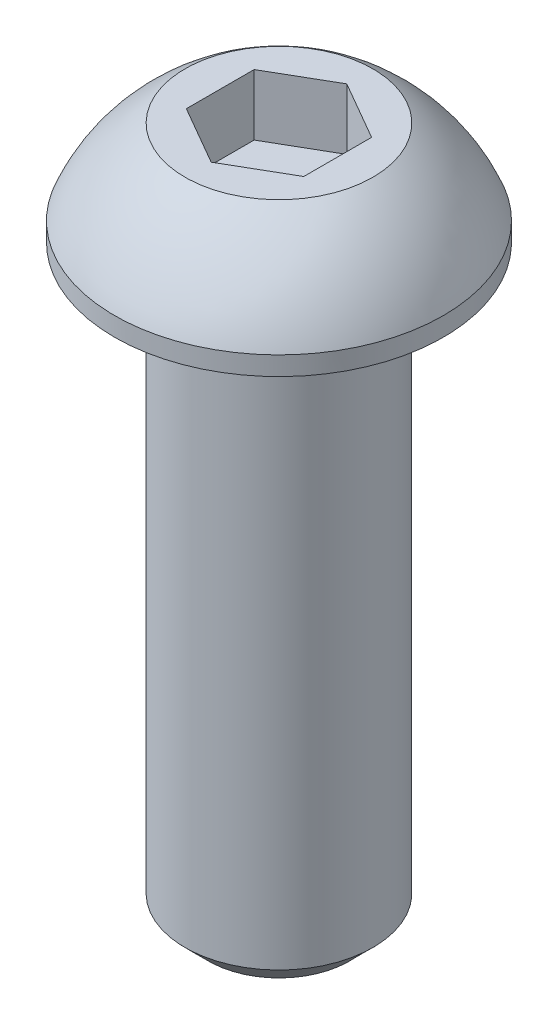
ISO-10303-21;
HEADER;
FILE_DESCRIPTION(('STEP AP214'),'2;1');
FILE_NAME('part.step','',(''),(''),'','','');
FILE_SCHEMA(('AUTOMOTIVE_DESIGN { 1 0 10303 214 1 1 1 1 }'));
ENDSEC;
DATA;
#1=APPLICATION_CONTEXT('core data for automotive mechanical design processes');
#2=APPLICATION_PROTOCOL_DEFINITION('international standard','automotive_design',2000,#1);
#3=PRODUCT_CONTEXT('',#1,'mechanical');
#4=PRODUCT('Part','Part','',(#3));
#5=PRODUCT_RELATED_PRODUCT_CATEGORY('part','',(#4));
#6=PRODUCT_DEFINITION_FORMATION('','',#4);
#7=PRODUCT_DEFINITION_CONTEXT('part definition',#1,'design');
#8=PRODUCT_DEFINITION('design','',#6,#7);
#9=PRODUCT_DEFINITION_SHAPE('','',#8);
#10=(LENGTH_UNIT() NAMED_UNIT(*) SI_UNIT(.MILLI.,.METRE.));
#11=(NAMED_UNIT(*) PLANE_ANGLE_UNIT() SI_UNIT($,.RADIAN.));
#12=(NAMED_UNIT(*) SI_UNIT($,.STERADIAN.) SOLID_ANGLE_UNIT());
#13=UNCERTAINTY_MEASURE_WITH_UNIT(LENGTH_MEASURE(1.E-05),#10,'distance_accuracy_value','');
#14=(GEOMETRIC_REPRESENTATION_CONTEXT(3) GLOBAL_UNCERTAINTY_ASSIGNED_CONTEXT((#13)) GLOBAL_UNIT_ASSIGNED_CONTEXT((#10,
#11,#12)) REPRESENTATION_CONTEXT('',''));
#15=CARTESIAN_POINT('',(0.,0.,0.));
#16=DIRECTION('',(0.,0.,1.));
#17=DIRECTION('',(1.,0.,0.));
#18=AXIS2_PLACEMENT_3D('',#15,#16,#17);
#19=CARTESIAN_POINT('',(0.,0.,0.));
#20=DIRECTION('',(0.,-1.,0.));
#21=DIRECTION('',(0.,0.,-1.));
#22=AXIS2_PLACEMENT_3D('',#19,#20,#21);
#23=PLANE('',#22);
#24=CARTESIAN_POINT('',(0.,0.,0.));
#25=DIRECTION('',(0.,-1.,0.));
#26=DIRECTION('',(0.,0.,-1.));
#27=AXIS2_PLACEMENT_3D('',#24,#25,#26);
#28=CIRCLE('',#27,4.);
#29=CARTESIAN_POINT('',(0.,0.,-4.00000000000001));
#30=VERTEX_POINT('',#29);
#31=EDGE_CURVE('E146',#30,#30,#28,.T.);
#32=ORIENTED_EDGE('',*,*,#31,.F.);
#33=EDGE_LOOP('',(#32));
#34=FACE_BOUND('',#33,.T.);
#35=CARTESIAN_POINT('',(0.,0.,0.));
#36=DIRECTION('',(0.,-1.,0.));
#37=DIRECTION('',(0.,0.,-1.));
#38=AXIS2_PLACEMENT_3D('',#35,#36,#37);
#39=CIRCLE('',#38,7.);
#40=CARTESIAN_POINT('',(0.,0.,-7.00000000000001));
#41=VERTEX_POINT('',#40);
#42=EDGE_CURVE('E143',#41,#41,#39,.T.);
#43=ORIENTED_EDGE('',*,*,#42,.T.);
#44=EDGE_LOOP('',(#43));
#45=FACE_BOUND('',#44,.T.);
#46=ADVANCED_FACE('F29',(#34,#45),#23,.T.);
#47=CARTESIAN_POINT('',(0.,0.,0.));
#48=DIRECTION('',(0.,-1.,0.));
#49=DIRECTION('',(0.,0.,-1.));
#50=AXIS2_PLACEMENT_3D('',#47,#48,#49);
#51=CYLINDRICAL_SURFACE('',#50,7.);
#52=CARTESIAN_POINT('',(0.,0.799999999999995,0.));
#53=DIRECTION('',(0.,-1.,0.));
#54=DIRECTION('',(0.,0.,-1.));
#55=AXIS2_PLACEMENT_3D('',#52,#53,#54);
#56=CIRCLE('',#55,7.);
#57=CARTESIAN_POINT('',(7.00000000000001,0.799999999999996,0.));
#58=VERTEX_POINT('',#57);
#59=EDGE_CURVE('E140',#58,#58,#56,.T.);
#60=ORIENTED_EDGE('',*,*,#59,.T.);
#61=EDGE_LOOP('',(#60));
#62=FACE_BOUND('',#61,.T.);
#63=ORIENTED_EDGE('',*,*,#42,.F.);
#64=EDGE_LOOP('',(#63));
#65=FACE_BOUND('',#64,.T.);
#66=ADVANCED_FACE('F165',(#62,#65),#51,.T.);
#67=CARTESIAN_POINT('',(0.,-1.98333333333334,0.));
#68=DIRECTION('',(0.,-1.,0.));
#69=DIRECTION('',(1.,0.,0.));
#70=AXIS2_PLACEMENT_3D('',#67,#68,#69);
#71=SPHERICAL_SURFACE('',#70,7.53305677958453);
#72=CARTESIAN_POINT('',(0.,4.40000000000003,0.));
#73=DIRECTION('',(0.,-1.,0.));
#74=DIRECTION('',(0.,0.,-1.));
#75=AXIS2_PLACEMENT_3D('',#72,#73,#74);
#76=CIRCLE('',#75,4.);
#77=CARTESIAN_POINT('',(3.99999999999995,4.40000000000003,0.));
#78=VERTEX_POINT('',#77);
#79=EDGE_CURVE('E131',#78,#78,#76,.T.);
#80=CARTESIAN_POINT('',(3.99999999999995,4.40000000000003,0.));
#81=CARTESIAN_POINT('',(4.04206169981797,4.37364288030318,0.));
#82=CARTESIAN_POINT('',(4.08386281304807,4.34686991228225,0.));
#83=CARTESIAN_POINT('',(4.16692769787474,4.29250299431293,0.));
#84=CARTESIAN_POINT('',(4.20819146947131,4.26490904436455,0.));
#85=CARTESIAN_POINT('',(4.29016550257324,4.20891087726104,0.));
#86=CARTESIAN_POINT('',(4.33087576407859,4.18050666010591,0.));
#87=CARTESIAN_POINT('',(4.41172688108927,4.12289907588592,0.));
#88=CARTESIAN_POINT('',(4.45186773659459,4.09369570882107,0.));
#89=CARTESIAN_POINT('',(4.53156435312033,4.03450123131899,0.));
#90=CARTESIAN_POINT('',(4.57112011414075,4.00451012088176,0.));
#91=CARTESIAN_POINT('',(4.64963108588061,3.94375187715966,0.));
#92=CARTESIAN_POINT('',(4.68858629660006,3.9129847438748,0.));
#93=CARTESIAN_POINT('',(4.76588094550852,3.85068647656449,0.));
#94=CARTESIAN_POINT('',(4.80422038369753,3.81915534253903,0.));
#95=CARTESIAN_POINT('',(4.88026850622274,3.75534139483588,0.));
#96=CARTESIAN_POINT('',(4.91797719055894,3.7230585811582,0.));
#97=CARTESIAN_POINT('',(4.99274907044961,3.65775388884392,0.));
#98=CARTESIAN_POINT('',(5.02981226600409,3.62473201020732,0.));
#99=CARTESIAN_POINT('',(5.10327868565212,3.55796209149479,0.));
#100=CARTESIAN_POINT('',(5.13968190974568,3.52421405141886,0.));
#101=CARTESIAN_POINT('',(5.21181416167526,3.45600499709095,0.));
#102=CARTESIAN_POINT('',(5.24754318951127,3.42154398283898,0.));
#103=CARTESIAN_POINT('',(5.31831308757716,3.35192244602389,0.));
#104=CARTESIAN_POINT('',(5.35335395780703,3.31676192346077,0.));
#105=CARTESIAN_POINT('',(5.42273384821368,3.24575510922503,0.));
#106=CARTESIAN_POINT('',(5.45707286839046,3.20990881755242,0.));
#107=CARTESIAN_POINT('',(5.52503564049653,3.13754447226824,0.));
#108=CARTESIAN_POINT('',(5.55865939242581,3.10102641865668,0.));
#109=CARTESIAN_POINT('',(5.62517848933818,3.02733281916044,0.));
#110=CARTESIAN_POINT('',(5.65807383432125,2.99015727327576,0.));
#111=CARTESIAN_POINT('',(5.72312326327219,2.91516321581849,0.));
#112=CARTESIAN_POINT('',(5.75527734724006,2.8773447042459,0.));
#113=CARTESIAN_POINT('',(5.81883168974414,2.801079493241,0.));
#114=CARTESIAN_POINT('',(5.85023194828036,2.76263279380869,0.));
#115=CARTESIAN_POINT('',(5.91226637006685,2.68512623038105,0.));
#116=CARTESIAN_POINT('',(5.94290053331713,2.6460663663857,0.));
#117=CARTESIAN_POINT('',(6.00339079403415,2.56734873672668,0.));
#118=CARTESIAN_POINT('',(6.03324689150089,2.527690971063,0.));
#119=CARTESIAN_POINT('',(6.09216935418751,2.44779303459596,0.));
#120=CARTESIAN_POINT('',(6.12123571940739,2.40755286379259,0.));
#121=CARTESIAN_POINT('',(6.17856735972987,2.32650584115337,0.));
#122=CARTESIAN_POINT('',(6.20683263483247,2.28569898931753,0.));
#123=CARTESIAN_POINT('',(6.26255105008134,2.20353455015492,0.));
#124=CARTESIAN_POINT('',(6.2900041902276,2.16217696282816,0.));
#125=CARTESIAN_POINT('',(6.34408760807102,2.07892721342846,0.));
#126=CARTESIAN_POINT('',(6.37071788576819,2.03703505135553,0.));
#127=CARTESIAN_POINT('',(6.42314517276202,1.95273252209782,0.));
#128=CARTESIAN_POINT('',(6.44894218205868,1.91032215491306,0.));
#129=CARTESIAN_POINT('',(6.49969285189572,1.82499978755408,0.));
#130=CARTESIAN_POINT('',(6.5246465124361,1.78208778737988,0.));
#131=CARTESIAN_POINT('',(6.57370073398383,1.6957789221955,0.));
#132=CARTESIAN_POINT('',(6.59780129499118,1.65238205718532,0.));
#133=CARTESIAN_POINT('',(6.64513989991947,1.56512041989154,0.));
#134=CARTESIAN_POINT('',(6.66837794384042,1.52125564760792,0.));
#135=CARTESIAN_POINT('',(6.7139824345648,1.43307533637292,0.));
#136=CARTESIAN_POINT('',(6.73634888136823,1.38875979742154,0.));
#137=CARTESIAN_POINT('',(6.78020143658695,1.29969526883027,0.));
#138=CARTESIAN_POINT('',(6.80168754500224,1.25494627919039,0.));
#139=CARTESIAN_POINT('',(6.84377103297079,1.1650323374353,0.));
#140=CARTESIAN_POINT('',(6.86436841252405,1.11986738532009,0.));
#141=CARTESIAN_POINT('',(6.90466637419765,1.02913915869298,0.));
#142=CARTESIAN_POINT('',(6.92436695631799,0.98357588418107,0.));
#143=CARTESIAN_POINT('',(6.96286369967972,0.892068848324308,0.));
#144=CARTESIAN_POINT('',(6.98165986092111,0.846125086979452,0.));
#145=CARTESIAN_POINT('',(7.00000000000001,0.799999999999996,0.));
#146=B_SPLINE_CURVE_WITH_KNOTS('',3,(#80,#81,#82,#83,#84,#85,#86,#87,#88,#89,#90,#91,#92,#93,
#94,#95,#96,#97,#98,#99,#100,#101,#102,#103,#104,#105,#106,#107,#108,#109,#110,#111,#112,#113,
#114,#115,#116,#117,#118,#119,#120,#121,#122,#123,#124,#125,#126,#127,#128,#129,#130,#131,#132,
#133,#134,#135,#136,#137,#138,#139,#140,#141,#142,#143,#144,#145),.UNSPECIFIED.,.F.,.F.,(4,2,2,
2,2,2,2,2,2,2,2,2,2,2,2,2,2,2,2,2,2,2,2,2,2,2,2,2,2,2,2,2,4),(0.,0.148910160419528,
0.297820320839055,0.446730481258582,0.595640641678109,0.744550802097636,0.893460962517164,
1.04237112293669,1.19128128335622,1.34019144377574,1.48910160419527,1.6380117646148,
1.78692192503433,1.93583208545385,2.08474224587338,2.23365240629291,2.38256256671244,
2.53147272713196,2.68038288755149,2.82929304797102,2.97820320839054,3.12711336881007,
3.2760235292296,3.42493368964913,3.57384385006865,3.72275401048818,3.87166417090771,
4.02057433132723,4.16948449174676,4.31839465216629,4.46730481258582,4.61621497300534,
4.76512513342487),.UNSPECIFIED.);
#147=EDGE_CURVE('BSEAM170',#78,#58,#146,.T.);
#148=ORIENTED_EDGE('',*,*,#79,.T.);
#149=ORIENTED_EDGE('',*,*,#59,.F.);
#150=ORIENTED_EDGE('',*,*,#147,.T.);
#151=ORIENTED_EDGE('',*,*,#147,.F.);
#152=EDGE_LOOP('',(#148,#150,#149,#151));
#153=FACE_BOUND('',#152,.T.);
#154=ADVANCED_FACE('F170',(#153),#71,.T.);
#155=CARTESIAN_POINT('',(4.,4.39999999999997,0.));
#156=DIRECTION('',(0.,1.,0.));
#157=DIRECTION('',(0.,0.,1.));
#158=AXIS2_PLACEMENT_3D('',#155,#156,#157);
#159=PLANE('',#158);
#160=DIRECTION('',(1.0206863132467E-11,0.,1.));
#161=VECTOR('',#160,1.);
#162=CARTESIAN_POINT('',(-2.50000000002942,4.40000000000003,-1.44337567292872));
#163=LINE('',#162,#161);
#164=CARTESIAN_POINT('',(-2.50000000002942,4.40000000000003,-1.44337567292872));
#165=VERTEX_POINT('',#164);
#166=CARTESIAN_POINT('',(-2.49999999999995,4.40000000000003,1.44337567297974));
#167=VERTEX_POINT('',#166);
#168=EDGE_CURVE('E43',#165,#167,#163,.T.);
#169=ORIENTED_EDGE('',*,*,#168,.F.);
#170=DIRECTION('',(-0.866025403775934,0.,0.500000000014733));
#171=VECTOR('',#170,1.);
#172=CARTESIAN_POINT('',(-4.42701431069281E-11,4.40000000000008,-2.88675134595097));
#173=LINE('',#172,#171);
#174=CARTESIAN_POINT('',(-4.42701431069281E-11,4.40000000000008,-2.88675134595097));
#175=VERTEX_POINT('',#174);
#176=EDGE_CURVE('E113',#175,#165,#173,.T.);
#177=ORIENTED_EDGE('',*,*,#176,.F.);
#178=DIRECTION('',(-0.866025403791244,0.,-0.499999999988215));
#179=VECTOR('',#178,1.);
#180=CARTESIAN_POINT('',(2.49999999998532,4.39999999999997,-1.44337567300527));
#181=LINE('',#180,#179);
#182=CARTESIAN_POINT('',(2.49999999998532,4.39999999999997,-1.44337567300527));
#183=VERTEX_POINT('',#182);
#184=EDGE_CURVE('E107',#183,#175,#181,.T.);
#185=ORIENTED_EDGE('',*,*,#184,.F.);
#186=DIRECTION('',(-1.02066965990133E-11,0.,-1.));
#187=VECTOR('',#186,1.);
#188=CARTESIAN_POINT('',(2.50000000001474,4.39999999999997,1.44337567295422));
#189=LINE('',#188,#187);
#190=CARTESIAN_POINT('',(2.50000000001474,4.39999999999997,1.44337567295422));
#191=VERTEX_POINT('',#190);
#192=EDGE_CURVE('E105',#191,#183,#189,.T.);
#193=ORIENTED_EDGE('',*,*,#192,.F.);
#194=DIRECTION('',(0.866025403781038,0.,-0.500000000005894));
#195=VECTOR('',#194,1.);
#196=CARTESIAN_POINT('',(1.46549439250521E-11,4.40000000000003,2.88675134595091));
#197=LINE('',#196,#195);
#198=CARTESIAN_POINT('',(1.46549439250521E-11,4.40000000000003,2.88675134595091));
#199=VERTEX_POINT('',#198);
#200=EDGE_CURVE('E86',#199,#191,#197,.T.);
#201=ORIENTED_EDGE('',*,*,#200,.F.);
#202=DIRECTION('',(0.866025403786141,0.,0.499999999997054));
#203=VECTOR('',#202,1.);
#204=CARTESIAN_POINT('',(-2.49999999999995,4.40000000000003,1.44337567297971));
#205=LINE('',#204,#203);
#206=EDGE_CURVE('E97',#167,#199,#205,.T.);
#207=ORIENTED_EDGE('',*,*,#206,.F.);
#208=EDGE_LOOP('',(#169,#177,#185,#193,#201,#207));
#209=FACE_BOUND('',#208,.T.);
#210=ORIENTED_EDGE('',*,*,#79,.F.);
#211=EDGE_LOOP('',(#210));
#212=FACE_BOUND('',#211,.T.);
#213=ADVANCED_FACE('F101',(#209,#212),#159,.T.);
#214=CARTESIAN_POINT('',(0.,0.,0.));
#215=DIRECTION('',(0.,-1.,0.));
#216=DIRECTION('',(0.,0.,-1.));
#217=AXIS2_PLACEMENT_3D('',#214,#215,#216);
#218=CYLINDRICAL_SURFACE('',#217,4.);
#219=CARTESIAN_POINT('',(0.,-24.,0.));
#220=DIRECTION('',(0.,-1.,0.));
#221=DIRECTION('',(0.,0.,-1.));
#222=AXIS2_PLACEMENT_3D('',#219,#220,#221);
#223=CIRCLE('',#222,4.);
#224=CARTESIAN_POINT('',(0.,-24.,-4.00000000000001));
#225=VERTEX_POINT('',#224);
#226=EDGE_CURVE('E11',#225,#225,#223,.F.);
#227=ORIENTED_EDGE('',*,*,#226,.T.);
#228=EDGE_LOOP('',(#227));
#229=FACE_BOUND('',#228,.T.);
#230=ORIENTED_EDGE('',*,*,#31,.T.);
#231=EDGE_LOOP('',(#230));
#232=FACE_BOUND('',#231,.T.);
#233=ADVANCED_FACE('F177',(#229,#232),#218,.T.);
#234=CARTESIAN_POINT('',(0.,-25.,0.));
#235=DIRECTION('',(0.,-1.,0.));
#236=DIRECTION('',(0.,0.,-1.));
#237=AXIS2_PLACEMENT_3D('',#234,#235,#236);
#238=PLANE('',#237);
#239=CARTESIAN_POINT('',(0.,-25.,0.));
#240=DIRECTION('',(0.,-1.,0.));
#241=DIRECTION('',(0.,0.,-1.));
#242=AXIS2_PLACEMENT_3D('',#239,#240,#241);
#243=CIRCLE('',#242,2.99999999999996);
#244=CARTESIAN_POINT('',(0.,-25.,-2.99999999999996));
#245=VERTEX_POINT('',#244);
#246=EDGE_CURVE('E36',#245,#245,#243,.T.);
#247=ORIENTED_EDGE('',*,*,#246,.T.);
#248=EDGE_LOOP('',(#247));
#249=FACE_BOUND('',#248,.T.);
#250=ADVANCED_FACE('F151',(#249),#238,.T.);
#251=CARTESIAN_POINT('',(-2.50000000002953,1.80000000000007,-1.44337567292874));
#252=DIRECTION('',(-1.,0.,1.0206863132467E-11));
#253=DIRECTION('',(1.0206863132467E-11,0.,1.));
#254=AXIS2_PLACEMENT_3D('',#251,#252,#253);
#255=PLANE('',#254);
#256=ORIENTED_EDGE('',*,*,#168,.T.);
#257=DIRECTION('',(0.,1.,0.));
#258=VECTOR('',#257,1.);
#259=CARTESIAN_POINT('',(-2.50000000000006,1.80000000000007,1.44337567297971));
#260=LINE('',#259,#258);
#261=CARTESIAN_POINT('',(-2.50000000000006,1.80000000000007,1.44337567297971));
#262=VERTEX_POINT('',#261);
#263=EDGE_CURVE('E94',#262,#167,#260,.T.);
#264=ORIENTED_EDGE('',*,*,#263,.F.);
#265=DIRECTION('',(1.0206863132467E-11,0.,1.));
#266=VECTOR('',#265,1.);
#267=CARTESIAN_POINT('',(-2.50000000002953,1.80000000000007,-1.44337567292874));
#268=LINE('',#267,#266);
#269=CARTESIAN_POINT('',(-2.50000000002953,1.80000000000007,-1.44337567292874));
#270=VERTEX_POINT('',#269);
#271=EDGE_CURVE('E115',#270,#262,#268,.T.);
#272=ORIENTED_EDGE('',*,*,#271,.F.);
#273=DIRECTION('',(0.,1.,0.));
#274=VECTOR('',#273,1.);
#275=CARTESIAN_POINT('',(-2.50000000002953,1.80000000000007,-1.44337567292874));
#276=LINE('',#275,#274);
#277=EDGE_CURVE('E50',#270,#165,#276,.T.);
#278=ORIENTED_EDGE('',*,*,#277,.T.);
#279=EDGE_LOOP('',(#256,#264,#272,#278));
#280=FACE_BOUND('',#279,.T.);
#281=ADVANCED_FACE('F185',(#280),#255,.F.);
#282=CARTESIAN_POINT('',(-4.43256542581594E-11,1.80000000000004,-2.88675134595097));
#283=DIRECTION('',(-0.500000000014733,0.,-0.866025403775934));
#284=DIRECTION('',(-0.866025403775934,0.,0.500000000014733));
#285=AXIS2_PLACEMENT_3D('',#282,#283,#284);
#286=PLANE('',#285);
#287=ORIENTED_EDGE('',*,*,#176,.T.);
#288=ORIENTED_EDGE('',*,*,#277,.F.);
#289=DIRECTION('',(-0.866025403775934,0.,0.500000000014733));
#290=VECTOR('',#289,1.);
#291=CARTESIAN_POINT('',(-4.43256542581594E-11,1.80000000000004,-2.88675134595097));
#292=LINE('',#291,#290);
#293=CARTESIAN_POINT('',(-4.43256542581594E-11,1.80000000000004,-2.88675134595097));
#294=VERTEX_POINT('',#293);
#295=EDGE_CURVE('E127',#294,#270,#292,.T.);
#296=ORIENTED_EDGE('',*,*,#295,.F.);
#297=DIRECTION('',(0.,1.,0.));
#298=VECTOR('',#297,1.);
#299=CARTESIAN_POINT('',(-4.43256542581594E-11,1.80000000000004,-2.88675134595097));
#300=LINE('',#299,#298);
#301=EDGE_CURVE('E132',#294,#175,#300,.T.);
#302=ORIENTED_EDGE('',*,*,#301,.T.);
#303=EDGE_LOOP('',(#287,#288,#296,#302));
#304=FACE_BOUND('',#303,.T.);
#305=ADVANCED_FACE('F222',(#304),#286,.F.);
#306=CARTESIAN_POINT('',(2.49999999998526,1.79999999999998,-1.44337567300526));
#307=DIRECTION('',(0.499999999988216,0.,-0.866025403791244));
#308=DIRECTION('',(-0.866025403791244,0.,-0.499999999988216));
#309=AXIS2_PLACEMENT_3D('',#306,#307,#308);
#310=PLANE('',#309);
#311=ORIENTED_EDGE('',*,*,#184,.T.);
#312=ORIENTED_EDGE('',*,*,#301,.F.);
#313=DIRECTION('',(-0.866025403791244,0.,-0.499999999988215));
#314=VECTOR('',#313,1.);
#315=CARTESIAN_POINT('',(2.49999999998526,1.79999999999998,-1.44337567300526));
#316=LINE('',#315,#314);
#317=CARTESIAN_POINT('',(2.49999999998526,1.79999999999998,-1.44337567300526));
#318=VERTEX_POINT('',#317);
#319=EDGE_CURVE('E124',#318,#294,#316,.T.);
#320=ORIENTED_EDGE('',*,*,#319,.F.);
#321=DIRECTION('',(0.,1.,0.));
#322=VECTOR('',#321,1.);
#323=CARTESIAN_POINT('',(2.49999999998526,1.79999999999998,-1.44337567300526));
#324=LINE('',#323,#322);
#325=EDGE_CURVE('E134',#318,#183,#324,.T.);
#326=ORIENTED_EDGE('',*,*,#325,.T.);
#327=EDGE_LOOP('',(#311,#312,#320,#326));
#328=FACE_BOUND('',#327,.T.);
#329=ADVANCED_FACE('F230',(#328),#310,.F.);
#330=CARTESIAN_POINT('',(2.50000000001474,1.79999999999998,1.44337567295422));
#331=DIRECTION('',(1.,0.,-1.02066965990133E-11));
#332=DIRECTION('',(-1.02066965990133E-11,0.,-1.));
#333=AXIS2_PLACEMENT_3D('',#330,#331,#332);
#334=PLANE('',#333);
#335=ORIENTED_EDGE('',*,*,#192,.T.);
#336=ORIENTED_EDGE('',*,*,#325,.F.);
#337=DIRECTION('',(-1.02066965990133E-11,0.,-1.));
#338=VECTOR('',#337,1.);
#339=CARTESIAN_POINT('',(2.50000000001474,1.79999999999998,1.44337567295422));
#340=LINE('',#339,#338);
#341=CARTESIAN_POINT('',(2.50000000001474,1.79999999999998,1.44337567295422));
#342=VERTEX_POINT('',#341);
#343=EDGE_CURVE('E121',#342,#318,#340,.T.);
#344=ORIENTED_EDGE('',*,*,#343,.F.);
#345=DIRECTION('',(0.,1.,0.));
#346=VECTOR('',#345,1.);
#347=CARTESIAN_POINT('',(2.50000000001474,1.79999999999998,1.44337567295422));
#348=LINE('',#347,#346);
#349=EDGE_CURVE('E93',#342,#191,#348,.T.);
#350=ORIENTED_EDGE('',*,*,#349,.T.);
#351=EDGE_LOOP('',(#335,#336,#344,#350));
#352=FACE_BOUND('',#351,.T.);
#353=ADVANCED_FACE('F239',(#352),#334,.F.);
#354=CARTESIAN_POINT('',(1.45716771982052E-11,1.80000000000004,2.88675134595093));
#355=DIRECTION('',(0.500000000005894,0.,0.866025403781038));
#356=DIRECTION('',(0.866025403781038,0.,-0.500000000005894));
#357=AXIS2_PLACEMENT_3D('',#354,#355,#356);
#358=PLANE('',#357);
#359=ORIENTED_EDGE('',*,*,#200,.T.);
#360=ORIENTED_EDGE('',*,*,#349,.F.);
#361=DIRECTION('',(0.866025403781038,0.,-0.500000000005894));
#362=VECTOR('',#361,1.);
#363=CARTESIAN_POINT('',(1.45716771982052E-11,1.80000000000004,2.88675134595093));
#364=LINE('',#363,#362);
#365=CARTESIAN_POINT('',(1.45716771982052E-11,1.80000000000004,2.88675134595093));
#366=VERTEX_POINT('',#365);
#367=EDGE_CURVE('E89',#366,#342,#364,.T.);
#368=ORIENTED_EDGE('',*,*,#367,.F.);
#369=DIRECTION('',(0.,1.,0.));
#370=VECTOR('',#369,1.);
#371=CARTESIAN_POINT('',(1.45716771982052E-11,1.80000000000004,2.88675134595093));
#372=LINE('',#371,#370);
#373=EDGE_CURVE('E82',#366,#199,#372,.T.);
#374=ORIENTED_EDGE('',*,*,#373,.T.);
#375=EDGE_LOOP('',(#359,#360,#368,#374));
#376=FACE_BOUND('',#375,.T.);
#377=ADVANCED_FACE('F84',(#376),#358,.F.);
#378=CARTESIAN_POINT('',(-2.50000000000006,1.80000000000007,1.44337567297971));
#379=DIRECTION('',(-0.499999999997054,0.,0.866025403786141));
#380=DIRECTION('',(0.866025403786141,0.,0.499999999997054));
#381=AXIS2_PLACEMENT_3D('',#378,#379,#380);
#382=PLANE('',#381);
#383=ORIENTED_EDGE('',*,*,#206,.T.);
#384=ORIENTED_EDGE('',*,*,#373,.F.);
#385=DIRECTION('',(0.866025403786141,0.,0.499999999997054));
#386=VECTOR('',#385,1.);
#387=CARTESIAN_POINT('',(-2.50000000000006,1.80000000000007,1.44337567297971));
#388=LINE('',#387,#386);
#389=EDGE_CURVE('E118',#262,#366,#388,.T.);
#390=ORIENTED_EDGE('',*,*,#389,.F.);
#391=ORIENTED_EDGE('',*,*,#263,.T.);
#392=EDGE_LOOP('',(#383,#384,#390,#391));
#393=FACE_BOUND('',#392,.T.);
#394=ADVANCED_FACE('F98',(#393),#382,.F.);
#395=CARTESIAN_POINT('',(-2.49999999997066,1.80000000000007,4.33012701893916));
#396=DIRECTION('',(0.,1.,0.));
#397=DIRECTION('',(0.,0.,1.));
#398=AXIS2_PLACEMENT_3D('',#395,#396,#397);
#399=PLANE('',#398);
#400=ORIENTED_EDGE('',*,*,#271,.T.);
#401=ORIENTED_EDGE('',*,*,#389,.T.);
#402=ORIENTED_EDGE('',*,*,#367,.T.);
#403=ORIENTED_EDGE('',*,*,#343,.T.);
#404=ORIENTED_EDGE('',*,*,#319,.T.);
#405=ORIENTED_EDGE('',*,*,#295,.T.);
#406=EDGE_LOOP('',(#400,#401,#402,#403,#404,#405));
#407=FACE_BOUND('',#406,.T.);
#408=ADVANCED_FACE('F155',(#407),#399,.T.);
#409=CARTESIAN_POINT('',(0.,-25.,0.));
#410=DIRECTION('',(0.,1.,0.));
#411=DIRECTION('',(0.,0.,1.));
#412=AXIS2_PLACEMENT_3D('',#409,#410,#411);
#413=CONICAL_SURFACE('',#412,2.99999999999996,0.785398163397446);
#414=ORIENTED_EDGE('',*,*,#226,.F.);
#415=EDGE_LOOP('',(#414));
#416=FACE_BOUND('',#415,.T.);
#417=ORIENTED_EDGE('',*,*,#246,.F.);
#418=EDGE_LOOP('',(#417));
#419=FACE_BOUND('',#418,.T.);
#420=ADVANCED_FACE('F153',(#416,#419),#413,.T.);
#421=CLOSED_SHELL('',(#46,#66,#154,#213,#233,#250,#281,#305,#329,#353,#377,#394,#408,#420));
#422=MANIFOLD_SOLID_BREP('B2',#421);
#423=ADVANCED_BREP_SHAPE_REPRESENTATION('',(#18,#422),#14);
#424=SHAPE_DEFINITION_REPRESENTATION(#9,#423);
ENDSEC;
END-ISO-10303-21;
